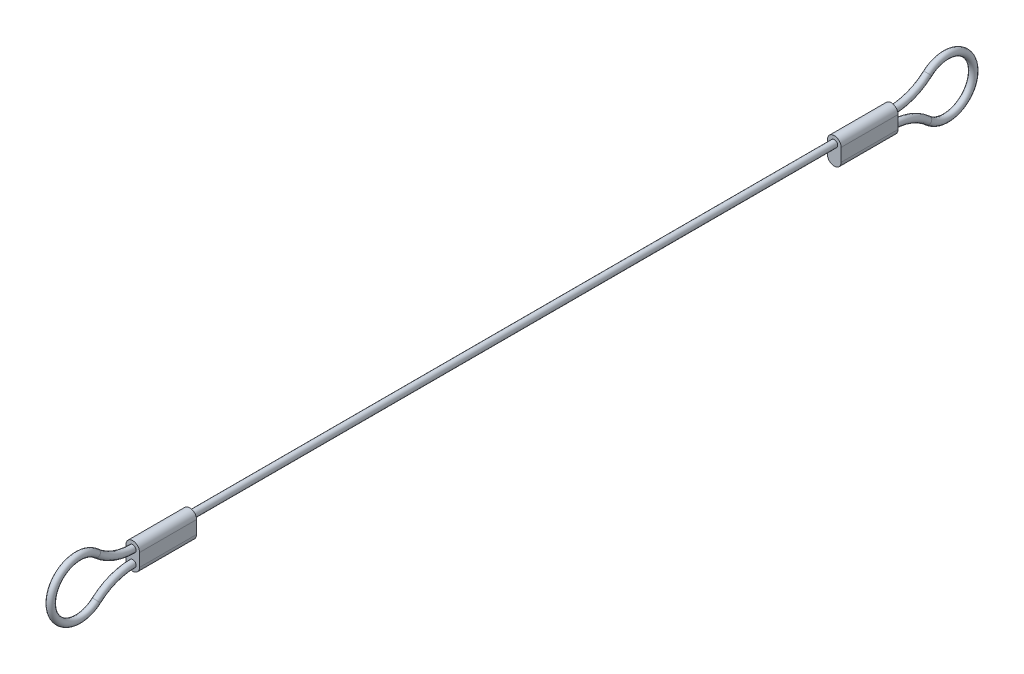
ISO-10303-21;
HEADER;
FILE_DESCRIPTION(('STEP AP214'),'2;1');
FILE_NAME('part.step','',(''),(''),'','','');
FILE_SCHEMA(('AUTOMOTIVE_DESIGN { 1 0 10303 214 1 1 1 1 }'));
ENDSEC;
DATA;
#1=APPLICATION_CONTEXT('core data for automotive mechanical design processes');
#2=APPLICATION_PROTOCOL_DEFINITION('international standard','automotive_design',2000,#1);
#3=PRODUCT_CONTEXT('',#1,'mechanical');
#4=PRODUCT('Part','Part','',(#3));
#5=PRODUCT_RELATED_PRODUCT_CATEGORY('part','',(#4));
#6=PRODUCT_DEFINITION_FORMATION('','',#4);
#7=PRODUCT_DEFINITION_CONTEXT('part definition',#1,'design');
#8=PRODUCT_DEFINITION('design','',#6,#7);
#9=PRODUCT_DEFINITION_SHAPE('','',#8);
#10=(LENGTH_UNIT() NAMED_UNIT(*) SI_UNIT(.MILLI.,.METRE.));
#11=(NAMED_UNIT(*) PLANE_ANGLE_UNIT() SI_UNIT($,.RADIAN.));
#12=(NAMED_UNIT(*) SI_UNIT($,.STERADIAN.) SOLID_ANGLE_UNIT());
#13=UNCERTAINTY_MEASURE_WITH_UNIT(LENGTH_MEASURE(1.E-05),#10,'distance_accuracy_value','');
#14=(GEOMETRIC_REPRESENTATION_CONTEXT(3) GLOBAL_UNCERTAINTY_ASSIGNED_CONTEXT((#13)) GLOBAL_UNIT_ASSIGNED_CONTEXT((#10,
#11,#12)) REPRESENTATION_CONTEXT('',''));
#15=CARTESIAN_POINT('',(0.,0.,0.));
#16=DIRECTION('',(0.,0.,1.));
#17=DIRECTION('',(1.,0.,0.));
#18=AXIS2_PLACEMENT_3D('',#15,#16,#17);
#19=CARTESIAN_POINT('',(0.,0.,-66.6));
#20=DIRECTION('',(0.,0.,1.));
#21=DIRECTION('',(1.,0.,0.));
#22=AXIS2_PLACEMENT_3D('',#19,#20,#21);
#23=CYLINDRICAL_SURFACE('',#22,0.595);
#24=CARTESIAN_POINT('',(0.,0.,-56.6));
#25=DIRECTION('',(0.,0.,1.));
#26=DIRECTION('',(0.,-1.,0.));
#27=AXIS2_PLACEMENT_3D('',#24,#25,#26);
#28=CIRCLE('',#27,0.595);
#29=CARTESIAN_POINT('',(0.,-0.595,-56.6));
#30=VERTEX_POINT('',#29);
#31=EDGE_CURVE('E11',#30,#30,#28,.F.);
#32=ORIENTED_EDGE('',*,*,#31,.F.);
#33=EDGE_LOOP('',(#32));
#34=FACE_BOUND('',#33,.T.);
#35=CARTESIAN_POINT('',(0.,0.,56.6));
#36=DIRECTION('',(0.,0.,-1.));
#37=DIRECTION('',(0.,1.,0.));
#38=AXIS2_PLACEMENT_3D('',#35,#36,#37);
#39=CIRCLE('',#38,0.595);
#40=CARTESIAN_POINT('',(0.,0.595,56.6));
#41=VERTEX_POINT('',#40);
#42=EDGE_CURVE('E51',#41,#41,#39,.F.);
#43=ORIENTED_EDGE('',*,*,#42,.F.);
#44=EDGE_LOOP('',(#43));
#45=FACE_BOUND('',#44,.T.);
#46=ADVANCED_FACE('F41',(#34,#45),#23,.T.);
#47=CARTESIAN_POINT('',(0.,0.,66.6));
#48=DIRECTION('',(0.,0.,-1.));
#49=DIRECTION('',(0.,1.,0.));
#50=AXIS2_PLACEMENT_3D('',#47,#48,#49);
#51=PLANE('',#50);
#52=CARTESIAN_POINT('',(0.,0.,66.6));
#53=DIRECTION('',(0.,0.,-1.));
#54=DIRECTION('',(0.,1.,0.));
#55=AXIS2_PLACEMENT_3D('',#52,#53,#54);
#56=CIRCLE('',#55,1.2);
#57=CARTESIAN_POINT('',(-1.2,0.,66.6));
#58=VERTEX_POINT('',#57);
#59=CARTESIAN_POINT('',(1.2,0.,66.6));
#60=VERTEX_POINT('',#59);
#61=EDGE_CURVE('E185',#58,#60,#56,.T.);
#62=ORIENTED_EDGE('',*,*,#61,.F.);
#63=DIRECTION('',(0.,1.,0.));
#64=VECTOR('',#63,1.);
#65=CARTESIAN_POINT('',(-1.2,0.,66.6));
#66=LINE('',#65,#64);
#67=CARTESIAN_POINT('',(-1.2,-2.26625258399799,66.6));
#68=VERTEX_POINT('',#67);
#69=EDGE_CURVE('E83',#68,#58,#66,.T.);
#70=ORIENTED_EDGE('',*,*,#69,.F.);
#71=CARTESIAN_POINT('',(0.,-2.26625258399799,66.6));
#72=DIRECTION('',(0.,0.,-1.));
#73=DIRECTION('',(0.,1.,0.));
#74=AXIS2_PLACEMENT_3D('',#71,#72,#73);
#75=CIRCLE('',#74,1.2);
#76=CARTESIAN_POINT('',(1.2,-2.26625258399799,66.6));
#77=VERTEX_POINT('',#76);
#78=EDGE_CURVE('E77',#77,#68,#75,.T.);
#79=ORIENTED_EDGE('',*,*,#78,.F.);
#80=DIRECTION('',(0.,-1.,0.));
#81=VECTOR('',#80,1.);
#82=CARTESIAN_POINT('',(1.2,0.,66.6));
#83=LINE('',#82,#81);
#84=EDGE_CURVE('E189',#60,#77,#83,.T.);
#85=ORIENTED_EDGE('',*,*,#84,.F.);
#86=EDGE_LOOP('',(#62,#70,#79,#85));
#87=FACE_BOUND('',#86,.T.);
#88=CARTESIAN_POINT('',(0.,0.,66.6));
#89=DIRECTION('',(0.,0.,-1.));
#90=DIRECTION('',(0.,1.,0.));
#91=AXIS2_PLACEMENT_3D('',#88,#89,#90);
#92=CIRCLE('',#91,0.595);
#93=CARTESIAN_POINT('',(0.,-0.595,66.6));
#94=VERTEX_POINT('',#93);
#95=EDGE_CURVE('E206',#94,#94,#92,.F.);
#96=ORIENTED_EDGE('',*,*,#95,.F.);
#97=EDGE_LOOP('',(#96));
#98=FACE_BOUND('',#97,.T.);
#99=CARTESIAN_POINT('',(0.,-2.26625258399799,66.6));
#100=DIRECTION('',(0.,0.,-1.));
#101=DIRECTION('',(1.,0.,0.));
#102=AXIS2_PLACEMENT_3D('',#99,#100,#101);
#103=CIRCLE('',#102,0.595);
#104=CARTESIAN_POINT('',(0.,-1.67125258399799,66.6));
#105=VERTEX_POINT('',#104);
#106=EDGE_CURVE('E233',#105,#105,#103,.T.);
#107=ORIENTED_EDGE('',*,*,#106,.T.);
#108=EDGE_LOOP('',(#107));
#109=FACE_BOUND('',#108,.T.);
#110=ADVANCED_FACE('F243',(#87,#98,#109),#51,.F.);
#111=CARTESIAN_POINT('',(0.,0.,56.6));
#112=DIRECTION('',(0.,0.,1.));
#113=DIRECTION('',(0.,-1.,0.));
#114=AXIS2_PLACEMENT_3D('',#111,#112,#113);
#115=CYLINDRICAL_SURFACE('',#114,1.2);
#116=ORIENTED_EDGE('',*,*,#61,.T.);
#117=DIRECTION('',(0.,0.,1.));
#118=VECTOR('',#117,1.);
#119=CARTESIAN_POINT('',(1.2,0.,56.6));
#120=LINE('',#119,#118);
#121=CARTESIAN_POINT('',(1.2,0.,56.6));
#122=VERTEX_POINT('',#121);
#123=EDGE_CURVE('E203',#122,#60,#120,.T.);
#124=ORIENTED_EDGE('',*,*,#123,.F.);
#125=CARTESIAN_POINT('',(0.,0.,56.6));
#126=DIRECTION('',(0.,0.,-1.));
#127=DIRECTION('',(0.,1.,0.));
#128=AXIS2_PLACEMENT_3D('',#125,#126,#127);
#129=CIRCLE('',#128,1.2);
#130=CARTESIAN_POINT('',(-1.2,0.,56.6));
#131=VERTEX_POINT('',#130);
#132=EDGE_CURVE('E174',#131,#122,#129,.T.);
#133=ORIENTED_EDGE('',*,*,#132,.F.);
#134=DIRECTION('',(0.,0.,1.));
#135=VECTOR('',#134,1.);
#136=CARTESIAN_POINT('',(-1.2,0.,56.6));
#137=LINE('',#136,#135);
#138=EDGE_CURVE('E184',#131,#58,#137,.T.);
#139=ORIENTED_EDGE('',*,*,#138,.T.);
#140=EDGE_LOOP('',(#116,#124,#133,#139));
#141=FACE_BOUND('',#140,.T.);
#142=ADVANCED_FACE('F249',(#141),#115,.T.);
#143=CARTESIAN_POINT('',(1.2,0.,56.6));
#144=DIRECTION('',(-1.,0.,0.));
#145=DIRECTION('',(0.,-1.,0.));
#146=AXIS2_PLACEMENT_3D('',#143,#144,#145);
#147=PLANE('',#146);
#148=ORIENTED_EDGE('',*,*,#84,.T.);
#149=DIRECTION('',(0.,0.,1.));
#150=VECTOR('',#149,1.);
#151=CARTESIAN_POINT('',(1.2,-2.266252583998,56.6));
#152=LINE('',#151,#150);
#153=CARTESIAN_POINT('',(1.2,-2.266252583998,56.6));
#154=VERTEX_POINT('',#153);
#155=EDGE_CURVE('E200',#154,#77,#152,.T.);
#156=ORIENTED_EDGE('',*,*,#155,.F.);
#157=DIRECTION('',(0.,-1.,0.));
#158=VECTOR('',#157,1.);
#159=CARTESIAN_POINT('',(1.2,0.,56.6));
#160=LINE('',#159,#158);
#161=EDGE_CURVE('E91',#122,#154,#160,.T.);
#162=ORIENTED_EDGE('',*,*,#161,.F.);
#163=ORIENTED_EDGE('',*,*,#123,.T.);
#164=EDGE_LOOP('',(#148,#156,#162,#163));
#165=FACE_BOUND('',#164,.T.);
#166=ADVANCED_FACE('F291',(#165),#147,.F.);
#167=CARTESIAN_POINT('',(0.,-2.266252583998,56.6));
#168=DIRECTION('',(0.,0.,1.));
#169=DIRECTION('',(0.,-1.,0.));
#170=AXIS2_PLACEMENT_3D('',#167,#168,#169);
#171=CYLINDRICAL_SURFACE('',#170,1.2);
#172=ORIENTED_EDGE('',*,*,#78,.T.);
#173=DIRECTION('',(0.,0.,1.));
#174=VECTOR('',#173,1.);
#175=CARTESIAN_POINT('',(-1.2,-2.266252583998,56.6));
#176=LINE('',#175,#174);
#177=CARTESIAN_POINT('',(-1.2,-2.266252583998,56.6));
#178=VERTEX_POINT('',#177);
#179=EDGE_CURVE('E197',#178,#68,#176,.T.);
#180=ORIENTED_EDGE('',*,*,#179,.F.);
#181=CARTESIAN_POINT('',(0.,-2.266252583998,56.6));
#182=DIRECTION('',(0.,0.,-1.));
#183=DIRECTION('',(0.,1.,0.));
#184=AXIS2_PLACEMENT_3D('',#181,#182,#183);
#185=CIRCLE('',#184,1.2);
#186=EDGE_CURVE('E179',#154,#178,#185,.T.);
#187=ORIENTED_EDGE('',*,*,#186,.F.);
#188=ORIENTED_EDGE('',*,*,#155,.T.);
#189=EDGE_LOOP('',(#172,#180,#187,#188));
#190=FACE_BOUND('',#189,.T.);
#191=ADVANCED_FACE('F284',(#190),#171,.T.);
#192=CARTESIAN_POINT('',(-1.2,0.,56.6));
#193=DIRECTION('',(1.,0.,0.));
#194=DIRECTION('',(0.,1.,0.));
#195=AXIS2_PLACEMENT_3D('',#192,#193,#194);
#196=PLANE('',#195);
#197=ORIENTED_EDGE('',*,*,#69,.T.);
#198=ORIENTED_EDGE('',*,*,#138,.F.);
#199=DIRECTION('',(0.,1.,0.));
#200=VECTOR('',#199,1.);
#201=CARTESIAN_POINT('',(-1.2,0.,56.6));
#202=LINE('',#201,#200);
#203=EDGE_CURVE('E59',#178,#131,#202,.T.);
#204=ORIENTED_EDGE('',*,*,#203,.F.);
#205=ORIENTED_EDGE('',*,*,#179,.T.);
#206=EDGE_LOOP('',(#197,#198,#204,#205));
#207=FACE_BOUND('',#206,.T.);
#208=ADVANCED_FACE('F279',(#207),#196,.F.);
#209=CARTESIAN_POINT('',(0.,0.,56.6));
#210=DIRECTION('',(0.,0.,-1.));
#211=DIRECTION('',(0.,1.,0.));
#212=AXIS2_PLACEMENT_3D('',#209,#210,#211);
#213=PLANE('',#212);
#214=ORIENTED_EDGE('',*,*,#42,.T.);
#215=EDGE_LOOP('',(#214));
#216=FACE_BOUND('',#215,.T.);
#217=ORIENTED_EDGE('',*,*,#132,.T.);
#218=ORIENTED_EDGE('',*,*,#161,.T.);
#219=ORIENTED_EDGE('',*,*,#186,.T.);
#220=ORIENTED_EDGE('',*,*,#203,.T.);
#221=EDGE_LOOP('',(#217,#218,#219,#220));
#222=FACE_BOUND('',#221,.T.);
#223=ADVANCED_FACE('F240',(#216,#222),#213,.T.);
#224=CARTESIAN_POINT('',(0.,-11.866252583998,66.6));
#225=DIRECTION('',(-1.,0.,0.));
#226=DIRECTION('',(0.,0.,1.));
#227=AXIS2_PLACEMENT_3D('',#224,#225,#226);
#228=TOROIDAL_SURFACE('',#227,9.59999999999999,0.595);
#229=CARTESIAN_POINT('',(0.,-4.71083505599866,73.));
#230=DIRECTION('',(0.,0.666666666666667,-0.74535599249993));
#231=DIRECTION('',(1.,0.,0.));
#232=AXIS2_PLACEMENT_3D('',#229,#230,#231);
#233=CIRCLE('',#232,0.595);
#234=CARTESIAN_POINT('',(0.,-4.2673482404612,73.3966666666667));
#235=VERTEX_POINT('',#234);
#236=EDGE_CURVE('E229',#235,#235,#233,.T.);
#237=CARTESIAN_POINT('',(0.,-11.866252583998,66.6));
#238=DIRECTION('',(-1.,0.,0.));
#239=DIRECTION('',(0.,0.,1.));
#240=AXIS2_PLACEMENT_3D('',#237,#238,#239);
#241=CIRCLE('',#240,10.195);
#242=EDGE_CURVE('',#235,#105,#241,.T.);
#243=ORIENTED_EDGE('',*,*,#236,.T.);
#244=ORIENTED_EDGE('',*,*,#106,.F.);
#245=ORIENTED_EDGE('',*,*,#242,.T.);
#246=ORIENTED_EDGE('',*,*,#242,.F.);
#247=EDGE_LOOP('',(#243,#245,#244,#246));
#248=FACE_BOUND('',#247,.T.);
#249=ADVANCED_FACE('F43',(#248),#228,.T.);
#250=CARTESIAN_POINT('',(0.,-1.13312629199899,76.2));
#251=DIRECTION('',(1.,0.,0.));
#252=DIRECTION('',(0.,0.,-1.));
#253=AXIS2_PLACEMENT_3D('',#250,#251,#252);
#254=TOROIDAL_SURFACE('',#253,4.8,0.595);
#255=ORIENTED_EDGE('',*,*,#236,.F.);
#256=EDGE_LOOP('',(#255));
#257=FACE_BOUND('',#256,.T.);
#258=CARTESIAN_POINT('',(0.,2.44458247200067,73.));
#259=DIRECTION('',(0.,0.666666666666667,0.74535599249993));
#260=DIRECTION('',(1.,0.,0.));
#261=AXIS2_PLACEMENT_3D('',#258,#259,#260);
#262=CIRCLE('',#261,0.595);
#263=CARTESIAN_POINT('',(0.,2.00109565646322,73.3966666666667));
#264=VERTEX_POINT('',#263);
#265=EDGE_CURVE('E225',#264,#264,#262,.T.);
#266=ORIENTED_EDGE('',*,*,#265,.T.);
#267=EDGE_LOOP('',(#266));
#268=FACE_BOUND('',#267,.T.);
#269=ADVANCED_FACE('F259',(#257,#268),#254,.T.);
#270=CARTESIAN_POINT('',(0.,9.59999999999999,66.6));
#271=DIRECTION('',(-1.,0.,0.));
#272=DIRECTION('',(0.,0.,1.));
#273=AXIS2_PLACEMENT_3D('',#270,#271,#272);
#274=TOROIDAL_SURFACE('',#273,9.59999999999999,0.595);
#275=CARTESIAN_POINT('',(0.,9.59999999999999,66.6));
#276=DIRECTION('',(-1.,0.,0.));
#277=DIRECTION('',(0.,0.,1.));
#278=AXIS2_PLACEMENT_3D('',#275,#276,#277);
#279=CIRCLE('',#278,10.195);
#280=EDGE_CURVE('',#94,#264,#279,.T.);
#281=ORIENTED_EDGE('',*,*,#95,.T.);
#282=ORIENTED_EDGE('',*,*,#265,.F.);
#283=ORIENTED_EDGE('',*,*,#280,.T.);
#284=ORIENTED_EDGE('',*,*,#280,.F.);
#285=EDGE_LOOP('',(#281,#283,#282,#284));
#286=FACE_BOUND('',#285,.T.);
#287=ADVANCED_FACE('F257',(#286),#274,.T.);
#288=CARTESIAN_POINT('',(0.,0.,-56.6));
#289=DIRECTION('',(0.,0.,-1.));
#290=DIRECTION('',(0.,1.,0.));
#291=AXIS2_PLACEMENT_3D('',#288,#289,#290);
#292=CYLINDRICAL_SURFACE('',#291,1.2);
#293=CARTESIAN_POINT('',(0.,0.,-66.6));
#294=DIRECTION('',(0.,0.,-1.));
#295=DIRECTION('',(0.,1.,0.));
#296=AXIS2_PLACEMENT_3D('',#293,#294,#295);
#297=CIRCLE('',#296,1.2);
#298=CARTESIAN_POINT('',(-1.2,0.,-66.6));
#299=VERTEX_POINT('',#298);
#300=CARTESIAN_POINT('',(1.2,0.,-66.6));
#301=VERTEX_POINT('',#300);
#302=EDGE_CURVE('E124',#299,#301,#297,.T.);
#303=ORIENTED_EDGE('',*,*,#302,.F.);
#304=DIRECTION('',(0.,0.,-1.));
#305=VECTOR('',#304,1.);
#306=CARTESIAN_POINT('',(-1.2,0.,-56.6));
#307=LINE('',#306,#305);
#308=CARTESIAN_POINT('',(-1.2,0.,-56.6));
#309=VERTEX_POINT('',#308);
#310=EDGE_CURVE('E118',#309,#299,#307,.T.);
#311=ORIENTED_EDGE('',*,*,#310,.F.);
#312=CARTESIAN_POINT('',(0.,0.,-56.6));
#313=DIRECTION('',(0.,0.,-1.));
#314=DIRECTION('',(0.,1.,0.));
#315=AXIS2_PLACEMENT_3D('',#312,#313,#314);
#316=CIRCLE('',#315,1.2);
#317=CARTESIAN_POINT('',(1.2,0.,-56.6));
#318=VERTEX_POINT('',#317);
#319=EDGE_CURVE('E121',#309,#318,#316,.T.);
#320=ORIENTED_EDGE('',*,*,#319,.T.);
#321=DIRECTION('',(0.,0.,-1.));
#322=VECTOR('',#321,1.);
#323=CARTESIAN_POINT('',(1.2,0.,-56.6));
#324=LINE('',#323,#322);
#325=EDGE_CURVE('E155',#318,#301,#324,.T.);
#326=ORIENTED_EDGE('',*,*,#325,.T.);
#327=EDGE_LOOP('',(#303,#311,#320,#326));
#328=FACE_BOUND('',#327,.T.);
#329=ADVANCED_FACE('F120',(#328),#292,.T.);
#330=CARTESIAN_POINT('',(-1.2,0.,-56.6));
#331=DIRECTION('',(-1.,0.,0.));
#332=DIRECTION('',(0.,-1.,0.));
#333=AXIS2_PLACEMENT_3D('',#330,#331,#332);
#334=PLANE('',#333);
#335=DIRECTION('',(0.,1.,0.));
#336=VECTOR('',#335,1.);
#337=CARTESIAN_POINT('',(-1.2,0.,-66.6));
#338=LINE('',#337,#336);
#339=CARTESIAN_POINT('',(-1.2,-2.26625258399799,-66.6));
#340=VERTEX_POINT('',#339);
#341=EDGE_CURVE('E158',#340,#299,#338,.T.);
#342=ORIENTED_EDGE('',*,*,#341,.F.);
#343=DIRECTION('',(0.,0.,-1.));
#344=VECTOR('',#343,1.);
#345=CARTESIAN_POINT('',(-1.2,-2.266252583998,-56.6));
#346=LINE('',#345,#344);
#347=CARTESIAN_POINT('',(-1.2,-2.266252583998,-56.6));
#348=VERTEX_POINT('',#347);
#349=EDGE_CURVE('E131',#348,#340,#346,.T.);
#350=ORIENTED_EDGE('',*,*,#349,.F.);
#351=DIRECTION('',(0.,1.,0.));
#352=VECTOR('',#351,1.);
#353=CARTESIAN_POINT('',(-1.2,0.,-56.6));
#354=LINE('',#353,#352);
#355=EDGE_CURVE('E137',#348,#309,#354,.T.);
#356=ORIENTED_EDGE('',*,*,#355,.T.);
#357=ORIENTED_EDGE('',*,*,#310,.T.);
#358=EDGE_LOOP('',(#342,#350,#356,#357));
#359=FACE_BOUND('',#358,.T.);
#360=ADVANCED_FACE('F144',(#359),#334,.T.);
#361=CARTESIAN_POINT('',(0.,-2.266252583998,-56.6));
#362=DIRECTION('',(0.,0.,-1.));
#363=DIRECTION('',(0.,1.,0.));
#364=AXIS2_PLACEMENT_3D('',#361,#362,#363);
#365=CYLINDRICAL_SURFACE('',#364,1.2);
#366=CARTESIAN_POINT('',(0.,-2.26625258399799,-66.6));
#367=DIRECTION('',(0.,0.,-1.));
#368=DIRECTION('',(0.,1.,0.));
#369=AXIS2_PLACEMENT_3D('',#366,#367,#368);
#370=CIRCLE('',#369,1.2);
#371=CARTESIAN_POINT('',(1.2,-2.26625258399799,-66.6));
#372=VERTEX_POINT('',#371);
#373=EDGE_CURVE('E161',#372,#340,#370,.T.);
#374=ORIENTED_EDGE('',*,*,#373,.F.);
#375=DIRECTION('',(0.,0.,-1.));
#376=VECTOR('',#375,1.);
#377=CARTESIAN_POINT('',(1.2,-2.266252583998,-56.6));
#378=LINE('',#377,#376);
#379=CARTESIAN_POINT('',(1.2,-2.266252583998,-56.6));
#380=VERTEX_POINT('',#379);
#381=EDGE_CURVE('E169',#380,#372,#378,.T.);
#382=ORIENTED_EDGE('',*,*,#381,.F.);
#383=CARTESIAN_POINT('',(0.,-2.266252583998,-56.6));
#384=DIRECTION('',(0.,0.,-1.));
#385=DIRECTION('',(0.,1.,0.));
#386=AXIS2_PLACEMENT_3D('',#383,#384,#385);
#387=CIRCLE('',#386,1.2);
#388=EDGE_CURVE('E146',#380,#348,#387,.T.);
#389=ORIENTED_EDGE('',*,*,#388,.T.);
#390=ORIENTED_EDGE('',*,*,#349,.T.);
#391=EDGE_LOOP('',(#374,#382,#389,#390));
#392=FACE_BOUND('',#391,.T.);
#393=ADVANCED_FACE('F324',(#392),#365,.T.);
#394=CARTESIAN_POINT('',(1.2,0.,-56.6));
#395=DIRECTION('',(1.,0.,0.));
#396=DIRECTION('',(0.,1.,0.));
#397=AXIS2_PLACEMENT_3D('',#394,#395,#396);
#398=PLANE('',#397);
#399=DIRECTION('',(0.,-1.,0.));
#400=VECTOR('',#399,1.);
#401=CARTESIAN_POINT('',(1.2,0.,-66.6));
#402=LINE('',#401,#400);
#403=EDGE_CURVE('E142',#301,#372,#402,.T.);
#404=ORIENTED_EDGE('',*,*,#403,.F.);
#405=ORIENTED_EDGE('',*,*,#325,.F.);
#406=DIRECTION('',(0.,-1.,0.));
#407=VECTOR('',#406,1.);
#408=CARTESIAN_POINT('',(1.2,0.,-56.6));
#409=LINE('',#408,#407);
#410=EDGE_CURVE('E140',#318,#380,#409,.T.);
#411=ORIENTED_EDGE('',*,*,#410,.T.);
#412=ORIENTED_EDGE('',*,*,#381,.T.);
#413=EDGE_LOOP('',(#404,#405,#411,#412));
#414=FACE_BOUND('',#413,.T.);
#415=ADVANCED_FACE('F321',(#414),#398,.T.);
#416=CARTESIAN_POINT('',(0.,0.,-56.6));
#417=DIRECTION('',(0.,0.,1.));
#418=DIRECTION('',(0.,1.,0.));
#419=AXIS2_PLACEMENT_3D('',#416,#417,#418);
#420=PLANE('',#419);
#421=ORIENTED_EDGE('',*,*,#31,.T.);
#422=EDGE_LOOP('',(#421));
#423=FACE_BOUND('',#422,.T.);
#424=ORIENTED_EDGE('',*,*,#319,.F.);
#425=ORIENTED_EDGE('',*,*,#355,.F.);
#426=ORIENTED_EDGE('',*,*,#388,.F.);
#427=ORIENTED_EDGE('',*,*,#410,.F.);
#428=EDGE_LOOP('',(#424,#425,#426,#427));
#429=FACE_BOUND('',#428,.T.);
#430=ADVANCED_FACE('F135',(#423,#429),#420,.T.);
#431=CARTESIAN_POINT('',(0.,0.,-66.6));
#432=DIRECTION('',(0.,0.,1.));
#433=DIRECTION('',(0.,1.,0.));
#434=AXIS2_PLACEMENT_3D('',#431,#432,#433);
#435=PLANE('',#434);
#436=CARTESIAN_POINT('',(0.,-2.26625258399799,-66.6));
#437=DIRECTION('',(0.,0.,-1.));
#438=DIRECTION('',(1.,0.,0.));
#439=AXIS2_PLACEMENT_3D('',#436,#437,#438);
#440=CIRCLE('',#439,0.595);
#441=CARTESIAN_POINT('',(0.,-1.67125258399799,-66.6));
#442=VERTEX_POINT('',#441);
#443=EDGE_CURVE('E130',#442,#442,#440,.T.);
#444=ORIENTED_EDGE('',*,*,#443,.F.);
#445=EDGE_LOOP('',(#444));
#446=FACE_BOUND('',#445,.T.);
#447=CARTESIAN_POINT('',(0.,0.,-66.6));
#448=DIRECTION('',(0.,0.,1.));
#449=DIRECTION('',(1.,0.,0.));
#450=AXIS2_PLACEMENT_3D('',#447,#448,#449);
#451=CIRCLE('',#450,0.595);
#452=CARTESIAN_POINT('',(0.,-0.595000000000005,-66.6));
#453=VERTEX_POINT('',#452);
#454=EDGE_CURVE('E221',#453,#453,#451,.T.);
#455=ORIENTED_EDGE('',*,*,#454,.T.);
#456=EDGE_LOOP('',(#455));
#457=FACE_BOUND('',#456,.T.);
#458=ORIENTED_EDGE('',*,*,#302,.T.);
#459=ORIENTED_EDGE('',*,*,#403,.T.);
#460=ORIENTED_EDGE('',*,*,#373,.T.);
#461=ORIENTED_EDGE('',*,*,#341,.T.);
#462=EDGE_LOOP('',(#458,#459,#460,#461));
#463=FACE_BOUND('',#462,.T.);
#464=ADVANCED_FACE('F300',(#446,#457,#463),#435,.F.);
#465=CARTESIAN_POINT('',(0.,-11.866252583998,-66.6));
#466=DIRECTION('',(-1.,0.,0.));
#467=DIRECTION('',(0.,0.,1.));
#468=AXIS2_PLACEMENT_3D('',#465,#466,#467);
#469=TOROIDAL_SURFACE('',#468,9.59999999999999,0.595);
#470=CARTESIAN_POINT('',(0.,-4.71083505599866,-73.));
#471=DIRECTION('',(0.,-0.666666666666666,-0.745355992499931));
#472=DIRECTION('',(1.,0.,0.));
#473=AXIS2_PLACEMENT_3D('',#470,#471,#472);
#474=CIRCLE('',#473,0.595);
#475=CARTESIAN_POINT('',(0.,-4.2673482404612,-73.3966666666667));
#476=VERTEX_POINT('',#475);
#477=EDGE_CURVE('E210',#476,#476,#474,.T.);
#478=CARTESIAN_POINT('',(0.,-11.866252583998,-66.6));
#479=DIRECTION('',(-1.,0.,0.));
#480=DIRECTION('',(0.,0.,1.));
#481=AXIS2_PLACEMENT_3D('',#478,#479,#480);
#482=CIRCLE('',#481,10.195);
#483=EDGE_CURVE('',#442,#476,#482,.T.);
#484=ORIENTED_EDGE('',*,*,#443,.T.);
#485=ORIENTED_EDGE('',*,*,#477,.F.);
#486=ORIENTED_EDGE('',*,*,#483,.T.);
#487=ORIENTED_EDGE('',*,*,#483,.F.);
#488=EDGE_LOOP('',(#484,#486,#485,#487));
#489=FACE_BOUND('',#488,.T.);
#490=ADVANCED_FACE('F297',(#489),#469,.T.);
#491=CARTESIAN_POINT('',(0.,-1.13312629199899,-76.2));
#492=DIRECTION('',(1.,0.,0.));
#493=DIRECTION('',(0.,0.,-1.));
#494=AXIS2_PLACEMENT_3D('',#491,#492,#493);
#495=TOROIDAL_SURFACE('',#494,4.8,0.595);
#496=CARTESIAN_POINT('',(0.,2.44458247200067,-73.));
#497=DIRECTION('',(0.,-0.666666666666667,0.74535599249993));
#498=DIRECTION('',(1.,0.,0.));
#499=AXIS2_PLACEMENT_3D('',#496,#497,#498);
#500=CIRCLE('',#499,0.595);
#501=CARTESIAN_POINT('',(0.,2.00109565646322,-73.3966666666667));
#502=VERTEX_POINT('',#501);
#503=EDGE_CURVE('E217',#502,#502,#500,.T.);
#504=ORIENTED_EDGE('',*,*,#503,.F.);
#505=EDGE_LOOP('',(#504));
#506=FACE_BOUND('',#505,.T.);
#507=ORIENTED_EDGE('',*,*,#477,.T.);
#508=EDGE_LOOP('',(#507));
#509=FACE_BOUND('',#508,.T.);
#510=ADVANCED_FACE('F299',(#506,#509),#495,.T.);
#511=CARTESIAN_POINT('',(0.,9.59999999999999,-66.6));
#512=DIRECTION('',(-1.,0.,0.));
#513=DIRECTION('',(0.,0.,1.));
#514=AXIS2_PLACEMENT_3D('',#511,#512,#513);
#515=TOROIDAL_SURFACE('',#514,9.6,0.595);
#516=CARTESIAN_POINT('',(0.,9.59999999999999,-66.6));
#517=DIRECTION('',(-1.,0.,0.));
#518=DIRECTION('',(0.,0.,1.));
#519=AXIS2_PLACEMENT_3D('',#516,#517,#518);
#520=CIRCLE('',#519,10.195);
#521=EDGE_CURVE('',#502,#453,#520,.T.);
#522=ORIENTED_EDGE('',*,*,#503,.T.);
#523=ORIENTED_EDGE('',*,*,#454,.F.);
#524=ORIENTED_EDGE('',*,*,#521,.T.);
#525=ORIENTED_EDGE('',*,*,#521,.F.);
#526=EDGE_LOOP('',(#522,#524,#523,#525));
#527=FACE_BOUND('',#526,.T.);
#528=ADVANCED_FACE('F255',(#527),#515,.T.);
#529=CLOSED_SHELL('',(#46,#110,#142,#166,#191,#208,#223,#249,#269,#287,#329,#360,#393,#415,#430,
#464,#490,#510,#528));
#530=MANIFOLD_SOLID_BREP('B2',#529);
#531=ADVANCED_BREP_SHAPE_REPRESENTATION('',(#18,#530),#14);
#532=SHAPE_DEFINITION_REPRESENTATION(#9,#531);
ENDSEC;
END-ISO-10303-21;
